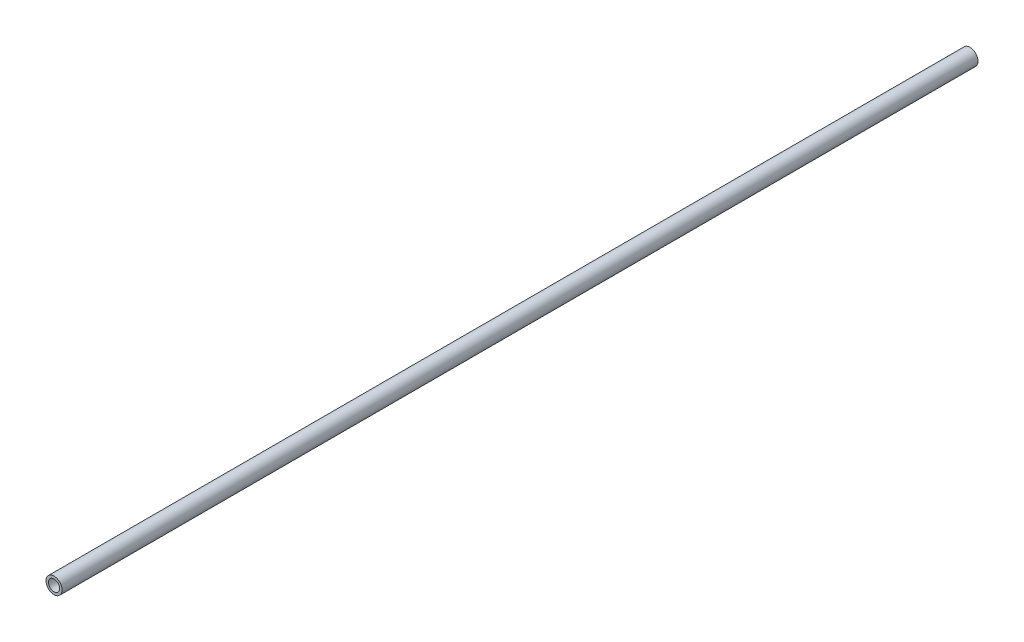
ISO-10303-21;
HEADER;
FILE_DESCRIPTION(('STEP AP214'),'2;1');
FILE_NAME('part.step','',(''),(''),'','','');
FILE_SCHEMA(('AUTOMOTIVE_DESIGN { 1 0 10303 214 1 1 1 1 }'));
ENDSEC;
DATA;
#1=APPLICATION_CONTEXT('core data for automotive mechanical design processes');
#2=APPLICATION_PROTOCOL_DEFINITION('international standard','automotive_design',2000,#1);
#3=PRODUCT_CONTEXT('',#1,'mechanical');
#4=PRODUCT('Part','Part','',(#3));
#5=PRODUCT_RELATED_PRODUCT_CATEGORY('part','',(#4));
#6=PRODUCT_DEFINITION_FORMATION('','',#4);
#7=PRODUCT_DEFINITION_CONTEXT('part definition',#1,'design');
#8=PRODUCT_DEFINITION('design','',#6,#7);
#9=PRODUCT_DEFINITION_SHAPE('','',#8);
#10=(LENGTH_UNIT() NAMED_UNIT(*) SI_UNIT(.MILLI.,.METRE.));
#11=(NAMED_UNIT(*) PLANE_ANGLE_UNIT() SI_UNIT($,.RADIAN.));
#12=(NAMED_UNIT(*) SI_UNIT($,.STERADIAN.) SOLID_ANGLE_UNIT());
#13=UNCERTAINTY_MEASURE_WITH_UNIT(LENGTH_MEASURE(1.E-05),#10,'distance_accuracy_value','');
#14=(GEOMETRIC_REPRESENTATION_CONTEXT(3) GLOBAL_UNCERTAINTY_ASSIGNED_CONTEXT((#13)) GLOBAL_UNIT_ASSIGNED_CONTEXT((#10,
#11,#12)) REPRESENTATION_CONTEXT('',''));
#15=CARTESIAN_POINT('',(0.,0.,0.));
#16=DIRECTION('',(0.,0.,1.));
#17=DIRECTION('',(1.,0.,0.));
#18=AXIS2_PLACEMENT_3D('',#15,#16,#17);
#19=CARTESIAN_POINT('',(0.,0.,10.));
#20=DIRECTION('',(0.,0.,1.));
#21=DIRECTION('',(-1.,0.,0.));
#22=AXIS2_PLACEMENT_3D('',#19,#20,#21);
#23=CYLINDRICAL_SURFACE('',#22,0.4953);
#24=CARTESIAN_POINT('',(0.,0.,70.));
#25=DIRECTION('',(0.,0.,1.));
#26=DIRECTION('',(-1.,0.,0.));
#27=AXIS2_PLACEMENT_3D('',#24,#25,#26);
#28=CIRCLE('',#27,0.4953);
#29=CARTESIAN_POINT('',(0.4953,0.,70.));
#30=VERTEX_POINT('',#29);
#31=EDGE_CURVE('E54',#30,#30,#28,.T.);
#32=ORIENTED_EDGE('',*,*,#31,.F.);
#33=DIRECTION('',(0.,0.,-1.));
#34=VECTOR('',#33,1.);
#35=CARTESIAN_POINT('',(0.4953,0.,10.));
#36=LINE('',#35,#34);
#37=CARTESIAN_POINT('',(0.4953,0.,13.7));
#38=VERTEX_POINT('',#37);
#39=EDGE_CURVE('E11',#30,#38,#36,.T.);
#40=ORIENTED_EDGE('',*,*,#39,.T.);
#41=CARTESIAN_POINT('',(0.,0.,13.7));
#42=DIRECTION('',(0.,0.,1.));
#43=DIRECTION('',(-1.,0.,0.));
#44=AXIS2_PLACEMENT_3D('',#41,#42,#43);
#45=CIRCLE('',#44,0.4953);
#46=EDGE_CURVE('E53',#38,#38,#45,.T.);
#47=ORIENTED_EDGE('',*,*,#46,.T.);
#48=ORIENTED_EDGE('',*,*,#39,.F.);
#49=EDGE_LOOP('',(#32,#40,#47,#48));
#50=FACE_BOUND('',#49,.T.);
#51=ADVANCED_FACE('F17',(#50),#23,.T.);
#52=CARTESIAN_POINT('',(0.,0.,10.));
#53=DIRECTION('',(0.,0.,1.));
#54=DIRECTION('',(-1.,0.,0.));
#55=AXIS2_PLACEMENT_3D('',#52,#53,#54);
#56=CYLINDRICAL_SURFACE('',#55,0.3429);
#57=CARTESIAN_POINT('',(0.,0.,70.));
#58=DIRECTION('',(0.,0.,-1.));
#59=DIRECTION('',(-1.,0.,0.));
#60=AXIS2_PLACEMENT_3D('',#57,#58,#59);
#61=CIRCLE('',#60,0.3429);
#62=CARTESIAN_POINT('',(0.3429,0.,70.));
#63=VERTEX_POINT('',#62);
#64=EDGE_CURVE('E57',#63,#63,#61,.T.);
#65=ORIENTED_EDGE('',*,*,#64,.F.);
#66=DIRECTION('',(0.,0.,-1.));
#67=VECTOR('',#66,1.);
#68=CARTESIAN_POINT('',(0.3429,0.,10.));
#69=LINE('',#68,#67);
#70=CARTESIAN_POINT('',(0.3429,0.,13.7));
#71=VERTEX_POINT('',#70);
#72=EDGE_CURVE('E25',#63,#71,#69,.T.);
#73=ORIENTED_EDGE('',*,*,#72,.T.);
#74=CARTESIAN_POINT('',(0.,0.,13.7));
#75=DIRECTION('',(0.,0.,-1.));
#76=DIRECTION('',(-1.,0.,0.));
#77=AXIS2_PLACEMENT_3D('',#74,#75,#76);
#78=CIRCLE('',#77,0.3429);
#79=EDGE_CURVE('E58',#71,#71,#78,.T.);
#80=ORIENTED_EDGE('',*,*,#79,.T.);
#81=ORIENTED_EDGE('',*,*,#72,.F.);
#82=EDGE_LOOP('',(#65,#73,#80,#81));
#83=FACE_BOUND('',#82,.T.);
#84=ADVANCED_FACE('F71',(#83),#56,.F.);
#85=CARTESIAN_POINT('',(0.,0.,70.));
#86=DIRECTION('',(0.,0.,1.));
#87=DIRECTION('',(1.,0.,0.));
#88=AXIS2_PLACEMENT_3D('',#85,#86,#87);
#89=PLANE('',#88);
#90=ORIENTED_EDGE('',*,*,#64,.T.);
#91=EDGE_LOOP('',(#90));
#92=FACE_BOUND('',#91,.T.);
#93=ORIENTED_EDGE('',*,*,#31,.T.);
#94=EDGE_LOOP('',(#93));
#95=FACE_BOUND('',#94,.T.);
#96=ADVANCED_FACE('F74',(#92,#95),#89,.T.);
#97=CARTESIAN_POINT('',(0.,0.,13.7));
#98=DIRECTION('',(0.,0.,-1.));
#99=DIRECTION('',(0.,-1.,0.));
#100=AXIS2_PLACEMENT_3D('',#97,#98,#99);
#101=PLANE('',#100);
#102=ORIENTED_EDGE('',*,*,#79,.F.);
#103=EDGE_LOOP('',(#102));
#104=FACE_BOUND('',#103,.T.);
#105=ORIENTED_EDGE('',*,*,#46,.F.);
#106=EDGE_LOOP('',(#105));
#107=FACE_BOUND('',#106,.T.);
#108=ADVANCED_FACE('F76',(#104,#107),#101,.T.);
#109=CLOSED_SHELL('',(#51,#84,#96,#108));
#110=MANIFOLD_SOLID_BREP('B1',#109);
#111=ADVANCED_BREP_SHAPE_REPRESENTATION('',(#18,#110),#14);
#112=SHAPE_DEFINITION_REPRESENTATION(#9,#111);
ENDSEC;
END-ISO-10303-21;
